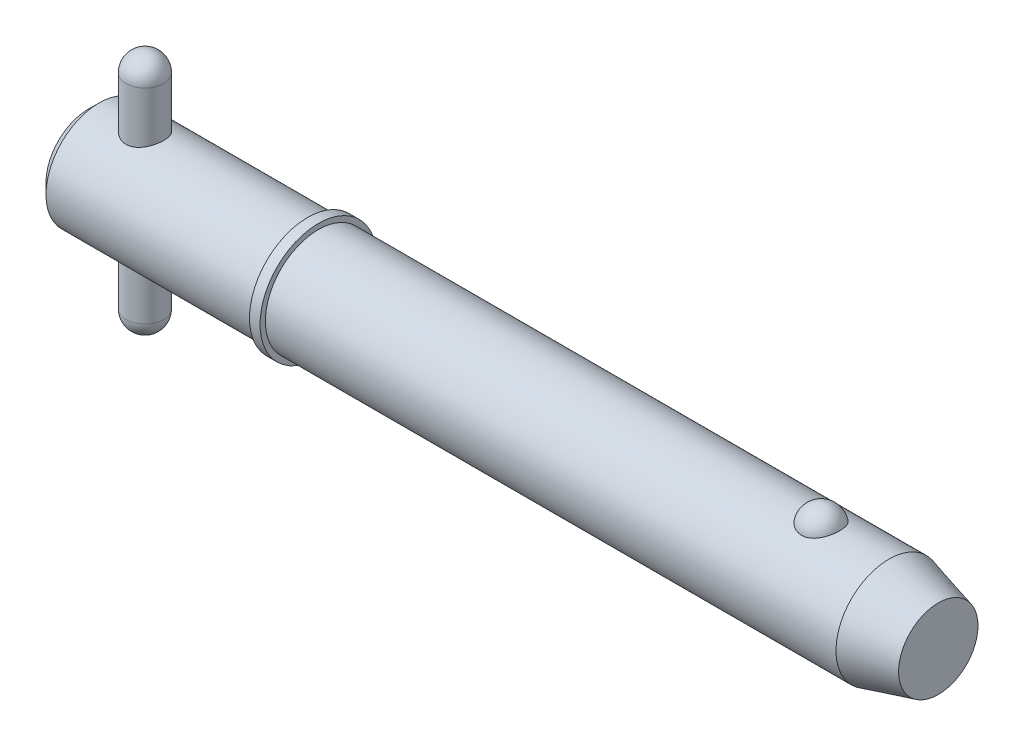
ISO-10303-21;
HEADER;
FILE_DESCRIPTION(('STEP AP214'),'2;1');
FILE_NAME('part.step','',(''),(''),'','','');
FILE_SCHEMA(('AUTOMOTIVE_DESIGN { 1 0 10303 214 1 1 1 1 }'));
ENDSEC;
DATA;
#1=APPLICATION_CONTEXT('core data for automotive mechanical design processes');
#2=APPLICATION_PROTOCOL_DEFINITION('international standard','automotive_design',2000,#1);
#3=PRODUCT_CONTEXT('',#1,'mechanical');
#4=PRODUCT('Part','Part','',(#3));
#5=PRODUCT_RELATED_PRODUCT_CATEGORY('part','',(#4));
#6=PRODUCT_DEFINITION_FORMATION('','',#4);
#7=PRODUCT_DEFINITION_CONTEXT('part definition',#1,'design');
#8=PRODUCT_DEFINITION('design','',#6,#7);
#9=PRODUCT_DEFINITION_SHAPE('','',#8);
#10=(LENGTH_UNIT() NAMED_UNIT(*) SI_UNIT(.MILLI.,.METRE.));
#11=(NAMED_UNIT(*) PLANE_ANGLE_UNIT() SI_UNIT($,.RADIAN.));
#12=(NAMED_UNIT(*) SI_UNIT($,.STERADIAN.) SOLID_ANGLE_UNIT());
#13=UNCERTAINTY_MEASURE_WITH_UNIT(LENGTH_MEASURE(1.E-05),#10,'distance_accuracy_value','');
#14=(GEOMETRIC_REPRESENTATION_CONTEXT(3) GLOBAL_UNCERTAINTY_ASSIGNED_CONTEXT((#13)) GLOBAL_UNIT_ASSIGNED_CONTEXT((#10,
#11,#12)) REPRESENTATION_CONTEXT('',''));
#15=CARTESIAN_POINT('',(0.,0.,0.));
#16=DIRECTION('',(0.,0.,1.));
#17=DIRECTION('',(1.,0.,0.));
#18=AXIS2_PLACEMENT_3D('',#15,#16,#17);
#19=CARTESIAN_POINT('',(5.94,12.7,0.));
#20=DIRECTION('',(0.,-1.,0.));
#21=DIRECTION('',(0.,0.,-1.));
#22=AXIS2_PLACEMENT_3D('',#19,#20,#21);
#23=CYLINDRICAL_SURFACE('',#22,1.98);
#24=CARTESIAN_POINT('',(5.94,-10.72,0.));
#25=DIRECTION('',(0.,-1.,0.));
#26=DIRECTION('',(0.,0.,-1.));
#27=AXIS2_PLACEMENT_3D('',#24,#25,#26);
#28=CIRCLE('',#27,1.98);
#29=CARTESIAN_POINT('',(5.94,-10.72,-1.98));
#30=VERTEX_POINT('',#29);
#31=EDGE_CURVE('P0_E10',#30,#30,#28,.F.);
#32=ORIENTED_EDGE('',*,*,#31,.T.);
#33=EDGE_LOOP('',(#32));
#34=FACE_BOUND('',#33,.T.);
#35=CARTESIAN_POINT('',(5.94,10.72,0.));
#36=DIRECTION('',(0.,-1.,0.));
#37=DIRECTION('',(0.,0.,-1.));
#38=AXIS2_PLACEMENT_3D('',#35,#36,#37);
#39=CIRCLE('',#38,1.98);
#40=CARTESIAN_POINT('',(5.94,10.72,-1.98));
#41=VERTEX_POINT('',#40);
#42=EDGE_CURVE('P0_E21',#41,#41,#39,.T.);
#43=ORIENTED_EDGE('',*,*,#42,.T.);
#44=EDGE_LOOP('',(#43));
#45=FACE_BOUND('',#44,.T.);
#46=ADVANCED_FACE('P0_F14',(#34,#45),#23,.T.);
#47=CARTESIAN_POINT('',(5.94,-10.72,0.));
#48=DIRECTION('',(0.,0.,1.));
#49=DIRECTION('',(1.,0.,0.));
#50=AXIS2_PLACEMENT_3D('',#47,#48,#49);
#51=SPHERICAL_SURFACE('',#50,1.98);
#52=CARTESIAN_POINT('',(5.94,-10.72,0.));
#53=DIRECTION('',(0.,-1.,0.));
#54=DIRECTION('',(0.,0.,-1.));
#55=AXIS2_PLACEMENT_3D('',#52,#53,#54);
#56=SPHERICAL_SURFACE('',#55,1.98);
#57=ORIENTED_EDGE('',*,*,#31,.F.);
#58=EDGE_LOOP('',(#57));
#59=FACE_BOUND('',#58,.T.);
#60=ADVANCED_FACE('P0_F29',(#59),#56,.T.);
#61=CARTESIAN_POINT('',(5.94,10.72,0.));
#62=DIRECTION('',(0.,0.,1.));
#63=DIRECTION('',(1.,0.,0.));
#64=AXIS2_PLACEMENT_3D('',#61,#62,#63);
#65=SPHERICAL_SURFACE('',#64,1.98);
#66=CARTESIAN_POINT('',(5.94,10.72,0.));
#67=DIRECTION('',(0.,-1.,0.));
#68=DIRECTION('',(0.,0.,-1.));
#69=AXIS2_PLACEMENT_3D('',#66,#67,#68);
#70=SPHERICAL_SURFACE('',#69,1.98);
#71=ORIENTED_EDGE('',*,*,#42,.F.);
#72=EDGE_LOOP('',(#71));
#73=FACE_BOUND('',#72,.T.);
#74=ADVANCED_FACE('P0_F16',(#73),#70,.T.);
#75=CLOSED_SHELL('',(#46,#60,#74));
#76=MANIFOLD_SOLID_BREP('P0_B1',#75);
#77=CARTESIAN_POINT('',(0.,0.,0.));
#78=DIRECTION('',(1.,0.,0.));
#79=DIRECTION('',(0.,0.,-1.));
#80=AXIS2_PLACEMENT_3D('',#77,#78,#79);
#81=CYLINDRICAL_SURFACE('',#80,5.555);
#82=CARTESIAN_POINT('',(84.0171144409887,0.,0.));
#83=DIRECTION('',(1.,0.,0.));
#84=DIRECTION('',(0.,0.,-1.));
#85=AXIS2_PLACEMENT_3D('',#82,#83,#84);
#86=CIRCLE('',#85,5.555);
#87=CARTESIAN_POINT('',(84.0171144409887,0.,-5.555));
#88=VERTEX_POINT('',#87);
#89=EDGE_CURVE('P1_E81',#88,#88,#86,.T.);
#90=ORIENTED_EDGE('',*,*,#89,.F.);
#91=EDGE_LOOP('',(#90));
#92=FACE_BOUND('',#91,.T.);
#93=CARTESIAN_POINT('',(24.13,0.,0.));
#94=DIRECTION('',(1.,0.,0.));
#95=DIRECTION('',(0.,0.,-1.));
#96=AXIS2_PLACEMENT_3D('',#93,#94,#95);
#97=CIRCLE('',#96,5.555);
#98=CARTESIAN_POINT('',(24.13,0.,-5.555));
#99=VERTEX_POINT('',#98);
#100=EDGE_CURVE('P1_E85',#99,#99,#97,.T.);
#101=ORIENTED_EDGE('',*,*,#100,.T.);
#102=EDGE_LOOP('',(#101));
#103=FACE_BOUND('',#102,.T.);
#104=CARTESIAN_POINT('',(76.8986264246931,5.16741224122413,2.03859650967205));
#105=CARTESIAN_POINT('',(76.7929492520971,5.16740893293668,2.03859990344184));
#106=CARTESIAN_POINT('',(76.68729894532,5.17079470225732,2.03008306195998));
#107=CARTESIAN_POINT('',(76.4791419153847,5.18392795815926,1.9963072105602));
#108=CARTESIAN_POINT('',(76.3766344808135,5.19367399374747,1.9710520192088));
#109=CARTESIAN_POINT('',(76.1777710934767,5.21839168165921,1.90463997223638));
#110=CARTESIAN_POINT('',(76.0814064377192,5.23335573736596,1.86350622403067));
#111=CARTESIAN_POINT('',(75.8970804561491,5.26688076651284,1.76652592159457));
#112=CARTESIAN_POINT('',(75.8091207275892,5.28544242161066,1.71067657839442));
#113=CARTESIAN_POINT('',(75.6412654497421,5.32479845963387,1.58399959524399));
#114=CARTESIAN_POINT('',(75.5616656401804,5.34564089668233,1.51279545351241));
#115=CARTESIAN_POINT('',(75.4151290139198,5.38697258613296,1.35828584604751));
#116=CARTESIAN_POINT('',(75.348194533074,5.40746177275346,1.27497815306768));
#117=CARTESIAN_POINT('',(75.2256103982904,5.44694508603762,1.09440293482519));
#118=CARTESIAN_POINT('',(75.1705989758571,5.46583143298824,0.996677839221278));
#119=CARTESIAN_POINT('',(75.0769376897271,5.49908030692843,0.792961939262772));
#120=CARTESIAN_POINT('',(75.0382894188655,5.513442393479,0.686970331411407));
#121=CARTESIAN_POINT('',(74.9776807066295,5.536358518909,0.468019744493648));
#122=CARTESIAN_POINT('',(74.9559725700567,5.54482455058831,0.354981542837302));
#123=CARTESIAN_POINT('',(74.9306362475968,5.55473324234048,0.126595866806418));
#124=CARTESIAN_POINT('',(74.9270077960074,5.55617600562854,0.0112484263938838));
#125=CARTESIAN_POINT('',(74.9378817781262,5.55189984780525,-0.218011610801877));
#126=CARTESIAN_POINT('',(74.9523151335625,5.54620821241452,-0.331928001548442));
#127=CARTESIAN_POINT('',(74.998903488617,5.52828920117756,-0.555544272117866));
#128=CARTESIAN_POINT('',(75.0310588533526,5.5160616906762,-0.665244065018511));
#129=CARTESIAN_POINT('',(75.1124883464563,5.48630779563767,-0.877469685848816));
#130=CARTESIAN_POINT('',(75.1617816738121,5.4687754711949,-0.979987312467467));
#131=CARTESIAN_POINT('',(75.2764785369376,5.43024700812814,-1.17486975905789));
#132=CARTESIAN_POINT('',(75.3418831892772,5.4092506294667,-1.26723387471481));
#133=CARTESIAN_POINT('',(75.4875712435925,5.36600927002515,-1.43940133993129));
#134=CARTESIAN_POINT('',(75.5678859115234,5.34376173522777,-1.5191776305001));
#135=CARTESIAN_POINT('',(75.7414520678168,5.30057971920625,-1.66360338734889));
#136=CARTESIAN_POINT('',(75.834702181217,5.27964509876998,-1.72825445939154));
#137=CARTESIAN_POINT('',(76.0293939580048,5.24205250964,-1.8390947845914));
#138=CARTESIAN_POINT('',(76.1305900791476,5.22530519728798,-1.88568407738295));
#139=CARTESIAN_POINT('',(76.3401552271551,5.19750919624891,-1.96100802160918));
#140=CARTESIAN_POINT('',(76.4485215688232,5.18645838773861,-1.98974931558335));
#141=CARTESIAN_POINT('',(76.6634989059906,5.17184410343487,-2.02742262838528));
#142=CARTESIAN_POINT('',(76.769925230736,5.16793282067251,-2.0372760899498));
#143=CARTESIAN_POINT('',(76.9829925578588,5.1669899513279,-2.03966777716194));
#144=CARTESIAN_POINT('',(77.0896335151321,5.16995704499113,-2.03220932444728));
#145=CARTESIAN_POINT('',(77.2967730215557,5.18222383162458,-2.0007117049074));
#146=CARTESIAN_POINT('',(77.3973599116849,5.19133213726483,-1.97717337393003));
#147=CARTESIAN_POINT('',(77.5930141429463,5.21467637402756,-1.91475248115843));
#148=CARTESIAN_POINT('',(77.6880810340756,5.22891272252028,-1.87586867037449));
#149=CARTESIAN_POINT('',(77.872371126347,5.26137066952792,-1.78282713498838));
#150=CARTESIAN_POINT('',(77.9614190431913,5.27967329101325,-1.7283512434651));
#151=CARTESIAN_POINT('',(78.1292880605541,5.31817411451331,-1.60597483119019));
#152=CARTESIAN_POINT('',(78.2081068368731,5.33837274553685,-1.53807126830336));
#153=CARTESIAN_POINT('',(78.3575156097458,5.37968287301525,-1.38688970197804));
#154=CARTESIAN_POINT('',(78.4275058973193,5.40079011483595,-1.30301744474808));
#155=CARTESIAN_POINT('',(78.5530125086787,5.44074401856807,-1.12458170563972));
#156=CARTESIAN_POINT('',(78.6085262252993,5.45959027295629,-1.03001630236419));
#157=CARTESIAN_POINT('',(78.7055507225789,5.49369849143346,-0.829439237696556));
#158=CARTESIAN_POINT('',(78.7465483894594,5.50882422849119,-0.723155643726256));
#159=CARTESIAN_POINT('',(78.8111250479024,5.53310911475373,-0.504772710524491));
#160=CARTESIAN_POINT('',(78.8347036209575,5.54226812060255,-0.39267323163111));
#161=CARTESIAN_POINT('',(78.864013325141,5.55370358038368,-0.165459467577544));
#162=CARTESIAN_POINT('',(78.8696884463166,5.55595843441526,-0.0503368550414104));
#163=CARTESIAN_POINT('',(78.862916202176,5.55329317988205,0.179288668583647));
#164=CARTESIAN_POINT('',(78.8504690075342,5.54837313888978,0.293791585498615));
#165=CARTESIAN_POINT('',(78.8077798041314,5.53189037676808,0.518526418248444));
#166=CARTESIAN_POINT('',(78.777598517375,5.5203503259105,0.628771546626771));
#167=CARTESIAN_POINT('',(78.7000962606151,5.49182453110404,0.84231815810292));
#168=CARTESIAN_POINT('',(78.6527743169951,5.47483847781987,0.945619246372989));
#169=CARTESIAN_POINT('',(78.5417204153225,5.43710633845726,1.14281571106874));
#170=CARTESIAN_POINT('',(78.4779215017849,5.41634501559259,1.23667048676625));
#171=CARTESIAN_POINT('',(78.3353577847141,5.37334572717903,1.4118524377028));
#172=CARTESIAN_POINT('',(78.2565932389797,5.35110778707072,1.49317982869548));
#173=CARTESIAN_POINT('',(78.0864234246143,5.30779474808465,1.64049162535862));
#174=CARTESIAN_POINT('',(77.9951002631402,5.28671324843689,1.70656877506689));
#175=CARTESIAN_POINT('',(77.8017390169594,5.2480485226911,1.82201372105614));
#176=CARTESIAN_POINT('',(77.6997005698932,5.23046541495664,1.87138095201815));
#177=CARTESIAN_POINT('',(77.4836187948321,5.20042692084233,1.95335298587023));
#178=CARTESIAN_POINT('',(77.369260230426,5.18820192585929,1.98521734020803));
#179=CARTESIAN_POINT('',(77.1361307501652,5.17169804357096,2.02783294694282));
#180=CARTESIAN_POINT('',(77.0173616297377,5.16741595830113,2.03859269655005));
#181=CARTESIAN_POINT('',(76.8986264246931,5.16741224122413,2.03859650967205));
#182=B_SPLINE_CURVE_WITH_KNOTS('',3,(#104,#105,#106,#107,#108,#109,#110,#111,#112,#113,#114,
#115,#116,#117,#118,#119,#120,#121,#122,#123,#124,#125,#126,#127,#128,#129,#130,#131,#132,#133,
#134,#135,#136,#137,#138,#139,#140,#141,#142,#143,#144,#145,#146,#147,#148,#149,#150,#151,#152,
#153,#154,#155,#156,#157,#158,#159,#160,#161,#162,#163,#164,#165,#166,#167,#168,#169,#170,#171,
#172,#173,#174,#175,#176,#177,#178,#179,#180,#181),.UNSPECIFIED.,.T.,.F.,(4,2,2,2,2,2,2,2,2,2,2,
2,2,2,2,2,2,2,2,2,2,2,2,2,2,2,2,2,2,2,2,2,2,2,2,2,2,2,4),(0.,0.316595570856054,
0.633118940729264,0.949183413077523,1.26530783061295,1.59030762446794,1.91536729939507,
2.25495824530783,2.59458224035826,2.93917283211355,3.28375835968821,3.62703002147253,
3.97030875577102,4.3139732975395,4.65766166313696,5.00207904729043,5.3464598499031,
5.68270547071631,6.0188258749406,6.33808403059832,6.65728093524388,6.96696376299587,
7.27667180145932,7.59321535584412,7.90983070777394,8.24210387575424,8.57443684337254,
8.91755896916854,9.26068933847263,9.60489211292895,9.949091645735,10.2921194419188,
10.6351667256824,10.9796305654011,11.324088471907,11.666392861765,12.0087088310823,
12.3645679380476,12.7202837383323),.UNSPECIFIED.);
#183=CARTESIAN_POINT('',(76.8986264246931,5.16741224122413,2.03859650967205));
#184=VERTEX_POINT('',#183);
#185=EDGE_CURVE('P1_E35',#184,#184,#182,.T.);
#186=ORIENTED_EDGE('',*,*,#185,.T.);
#187=EDGE_LOOP('',(#186));
#188=FACE_BOUND('',#187,.T.);
#189=ADVANCED_FACE('P1_F13',(#92,#103,#188),#81,.T.);
#190=CARTESIAN_POINT('',(0.,0.,0.));
#191=DIRECTION('',(-1.,0.,0.));
#192=DIRECTION('',(0.,0.,1.));
#193=AXIS2_PLACEMENT_3D('',#190,#191,#192);
#194=PLANE('',#193);
#195=CARTESIAN_POINT('',(0.,0.,0.));
#196=DIRECTION('',(1.,0.,0.));
#197=DIRECTION('',(0.,0.,-1.));
#198=AXIS2_PLACEMENT_3D('',#195,#196,#197);
#199=CIRCLE('',#198,4.444);
#200=CARTESIAN_POINT('',(0.,0.,-4.444));
#201=VERTEX_POINT('',#200);
#202=EDGE_CURVE('P1_E9',#201,#201,#199,.T.);
#203=ORIENTED_EDGE('',*,*,#202,.F.);
#204=EDGE_LOOP('',(#203));
#205=FACE_BOUND('',#204,.T.);
#206=ADVANCED_FACE('P1_F15',(#205),#194,.T.);
#207=CARTESIAN_POINT('',(1.111,0.,0.));
#208=DIRECTION('',(1.,0.,0.));
#209=DIRECTION('',(0.,0.,-1.));
#210=AXIS2_PLACEMENT_3D('',#207,#208,#209);
#211=CONICAL_SURFACE('',#210,5.555,0.78539816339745);
#212=ORIENTED_EDGE('',*,*,#202,.T.);
#213=EDGE_LOOP('',(#212));
#214=FACE_BOUND('',#213,.T.);
#215=CARTESIAN_POINT('',(1.111,0.,0.));
#216=DIRECTION('',(1.,0.,0.));
#217=DIRECTION('',(0.,0.,-1.));
#218=AXIS2_PLACEMENT_3D('',#215,#216,#217);
#219=CIRCLE('',#218,5.555);
#220=CARTESIAN_POINT('',(1.111,0.,-5.555));
#221=VERTEX_POINT('',#220);
#222=EDGE_CURVE('P1_E26',#221,#221,#219,.T.);
#223=ORIENTED_EDGE('',*,*,#222,.F.);
#224=EDGE_LOOP('',(#223));
#225=FACE_BOUND('',#224,.T.);
#226=ADVANCED_FACE('P1_F77',(#214,#225),#211,.T.);
#227=CARTESIAN_POINT('',(0.,0.,0.));
#228=DIRECTION('',(1.,0.,0.));
#229=DIRECTION('',(0.,0.,-1.));
#230=AXIS2_PLACEMENT_3D('',#227,#228,#229);
#231=CYLINDRICAL_SURFACE('',#230,5.555);
#232=CARTESIAN_POINT('',(5.94,-5.19014691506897,1.98));
#233=CARTESIAN_POINT('',(5.83264687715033,-5.19014494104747,1.98000226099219));
#234=CARTESIAN_POINT('',(5.7253094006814,-5.19351395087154,1.97123988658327));
#235=CARTESIAN_POINT('',(5.51384517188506,-5.20654291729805,1.93656219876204));
#236=CARTESIAN_POINT('',(5.40971858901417,-5.21620320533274,1.91064598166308));
#237=CARTESIAN_POINT('',(5.20778082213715,-5.24058443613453,1.84271148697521));
#238=CARTESIAN_POINT('',(5.10995634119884,-5.25529427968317,1.80072850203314));
#239=CARTESIAN_POINT('',(4.92270352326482,-5.28810012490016,1.70197537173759));
#240=CARTESIAN_POINT('',(4.83327743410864,-5.3061970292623,1.64520128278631));
#241=CARTESIAN_POINT('',(4.66135184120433,-5.34464714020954,1.51575187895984));
#242=CARTESIAN_POINT('',(4.57928277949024,-5.36506222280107,1.44252311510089));
#243=CARTESIAN_POINT('',(4.42829115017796,-5.40532920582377,1.28342047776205));
#244=CARTESIAN_POINT('',(4.35937105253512,-5.42518099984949,1.19754423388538));
#245=CARTESIAN_POINT('',(4.23461605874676,-5.46281133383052,1.01237205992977));
#246=CARTESIAN_POINT('',(4.17924129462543,-5.48050875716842,0.912748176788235));
#247=CARTESIAN_POINT('',(4.0862117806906,-5.51109938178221,0.70485824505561));
#248=CARTESIAN_POINT('',(4.0485515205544,-5.52399407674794,0.596594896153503));
#249=CARTESIAN_POINT('',(3.99350662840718,-5.54308759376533,0.379019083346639));
#250=CARTESIAN_POINT('',(3.97538263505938,-5.54952987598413,0.269915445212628));
#251=CARTESIAN_POINT('',(3.95756405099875,-5.55586205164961,0.0500378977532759));
#252=CARTESIAN_POINT('',(3.95786404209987,-5.55575387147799,-0.060735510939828));
#253=CARTESIAN_POINT('',(3.97643665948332,-5.54915684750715,-0.275539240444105));
#254=CARTESIAN_POINT('',(3.99390415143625,-5.54295384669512,-0.379649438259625));
#255=CARTESIAN_POINT('',(4.0449721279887,-5.52523170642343,-0.583350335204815));
#256=CARTESIAN_POINT('',(4.07857373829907,-5.51371219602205,-0.682940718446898));
#257=CARTESIAN_POINT('',(4.16137312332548,-5.4863099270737,-0.876423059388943));
#258=CARTESIAN_POINT('',(4.2107826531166,-5.47036834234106,-0.970215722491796));
#259=CARTESIAN_POINT('',(4.32361427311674,-5.43575653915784,-1.1484017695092));
#260=CARTESIAN_POINT('',(4.38704062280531,-5.41708549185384,-1.23279228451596));
#261=CARTESIAN_POINT('',(4.53006791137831,-5.37778429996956,-1.39454579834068));
#262=CARTESIAN_POINT('',(4.61035105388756,-5.35710277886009,-1.4712940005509));
#263=CARTESIAN_POINT('',(4.78279835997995,-5.31692766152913,-1.6104545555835));
#264=CARTESIAN_POINT('',(4.874964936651,-5.29743430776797,-1.67286398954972));
#265=CARTESIAN_POINT('',(5.07076688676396,-5.26153775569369,-1.78259698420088));
#266=CARTESIAN_POINT('',(5.17458163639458,-5.24519780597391,-1.8296227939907));
#267=CARTESIAN_POINT('',(5.38938990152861,-5.21818744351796,-1.90530278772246));
#268=CARTESIAN_POINT('',(5.50037985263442,-5.20751423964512,-1.93396601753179));
#269=CARTESIAN_POINT('',(5.72036376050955,-5.19369176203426,-1.97077654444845));
#270=CARTESIAN_POINT('',(5.82917370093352,-5.19018851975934,-1.97989015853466));
#271=CARTESIAN_POINT('',(6.04680100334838,-5.19010609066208,-1.98010779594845));
#272=CARTESIAN_POINT('',(6.15561835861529,-5.19352540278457,-1.97121572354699));
#273=CARTESIAN_POINT('',(6.36548036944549,-5.20654623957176,-1.93654727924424));
#274=CARTESIAN_POINT('',(6.46666051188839,-5.21588705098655,-1.91148218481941));
#275=CARTESIAN_POINT('',(6.66334537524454,-5.23939939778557,-1.84605494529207));
#276=CARTESIAN_POINT('',(6.75884899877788,-5.25357186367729,-1.8056898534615));
#277=CARTESIAN_POINT('',(6.94517989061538,-5.28576258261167,-1.70921153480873));
#278=CARTESIAN_POINT('',(7.03572661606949,-5.30389804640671,-1.65259670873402));
#279=CARTESIAN_POINT('',(7.20638087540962,-5.34176077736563,-1.52577523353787));
#280=CARTESIAN_POINT('',(7.28648490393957,-5.36148857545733,-1.45556404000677));
#281=CARTESIAN_POINT('',(7.43864697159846,-5.40165494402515,-1.2988614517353));
#282=CARTESIAN_POINT('',(7.50999887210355,-5.42207106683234,-1.21167640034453));
#283=CARTESIAN_POINT('',(7.63712639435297,-5.46023601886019,-1.026066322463));
#284=CARTESIAN_POINT('',(7.69290228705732,-5.47798489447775,-0.927641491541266));
#285=CARTESIAN_POINT('',(7.78684673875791,-5.50876590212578,-0.722633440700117));
#286=CARTESIAN_POINT('',(7.82510508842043,-5.52182201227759,-0.616095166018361));
#287=CARTESIAN_POINT('',(7.88297051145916,-5.54184206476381,-0.397530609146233));
#288=CARTESIAN_POINT('',(7.90258540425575,-5.5488085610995,-0.285506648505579));
#289=CARTESIAN_POINT('',(7.9218262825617,-5.55564472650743,-0.065566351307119));
#290=CARTESIAN_POINT('',(7.92245987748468,-5.55587212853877,0.0422515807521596));
#291=CARTESIAN_POINT('',(7.90626329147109,-5.55011340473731,0.256387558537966));
#292=CARTESIAN_POINT('',(7.88943488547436,-5.54412791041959,0.362705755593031));
#293=CARTESIAN_POINT('',(7.83948457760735,-5.52676548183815,0.568649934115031));
#294=CARTESIAN_POINT('',(7.8067003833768,-5.51550046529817,0.668367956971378));
#295=CARTESIAN_POINT('',(7.72609369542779,-5.48874437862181,0.860911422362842));
#296=CARTESIAN_POINT('',(7.67826838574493,-5.47325251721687,0.953735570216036));
#297=CARTESIAN_POINT('',(7.56675024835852,-5.43884382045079,1.13391068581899));
#298=CARTESIAN_POINT('',(7.50249968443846,-5.41981485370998,1.22089468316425));
#299=CARTESIAN_POINT('',(7.36086495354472,-5.38069275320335,1.38316665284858));
#300=CARTESIAN_POINT('',(7.28347630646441,-5.36059925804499,1.45845061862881));
#301=CARTESIAN_POINT('',(7.11347587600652,-5.32048380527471,1.59876646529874));
#302=CARTESIAN_POINT('',(7.02032386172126,-5.30050854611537,1.66315951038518));
#303=CARTESIAN_POINT('',(6.82388804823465,-5.26398994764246,1.77536801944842));
#304=CARTESIAN_POINT('',(6.7206049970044,-5.24744635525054,1.82318470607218));
#305=CARTESIAN_POINT('',(6.50639706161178,-5.21987969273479,1.90068230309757));
#306=CARTESIAN_POINT('',(6.3954529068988,-5.20887116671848,1.93031547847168));
#307=CARTESIAN_POINT('',(6.16966522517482,-5.19400760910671,1.96996824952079));
#308=CARTESIAN_POINT('',(6.05482366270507,-5.19014902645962,1.97999758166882));
#309=CARTESIAN_POINT('',(5.94,-5.19014691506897,1.98));
#310=B_SPLINE_CURVE_WITH_KNOTS('',3,(#232,#233,#234,#235,#236,#237,#238,#239,#240,#241,#242,
#243,#244,#245,#246,#247,#248,#249,#250,#251,#252,#253,#254,#255,#256,#257,#258,#259,#260,#261,
#262,#263,#264,#265,#266,#267,#268,#269,#270,#271,#272,#273,#274,#275,#276,#277,#278,#279,#280,
#281,#282,#283,#284,#285,#286,#287,#288,#289,#290,#291,#292,#293,#294,#295,#296,#297,#298,#299,
#300,#301,#302,#303,#304,#305,#306,#307,#308,#309),.UNSPECIFIED.,.T.,.F.,(4,2,2,2,2,2,2,2,2,2,2,
2,2,2,2,2,2,2,2,2,2,2,2,2,2,2,2,2,2,2,2,2,2,2,2,2,2,2,4),(0.,0.321632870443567,
0.643282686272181,0.964229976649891,1.28526292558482,1.61937087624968,1.9535415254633,
2.29784481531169,2.64204093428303,2.97269632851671,3.30325448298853,3.61901541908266,
3.93479838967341,4.25500220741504,4.57530346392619,4.91268648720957,5.25013812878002,
5.59378026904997,5.93725299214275,6.26331481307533,6.58930593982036,6.90185604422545,
7.21446637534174,7.53801472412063,7.86167140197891,8.20353561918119,8.54539388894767,
8.88547970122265,9.22542281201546,9.54728637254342,9.86911722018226,10.1844146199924,
10.4997710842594,10.827730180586,11.1558013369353,11.499115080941,11.8424034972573,
12.1865892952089,12.5306041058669),.UNSPECIFIED.);
#311=CARTESIAN_POINT('',(5.94,-5.19014691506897,1.98));
#312=VERTEX_POINT('',#311);
#313=EDGE_CURVE('P1_E17',#312,#312,#310,.T.);
#314=ORIENTED_EDGE('',*,*,#313,.F.);
#315=EDGE_LOOP('',(#314));
#316=FACE_BOUND('',#315,.T.);
#317=CARTESIAN_POINT('',(5.94,5.19014691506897,1.98));
#318=CARTESIAN_POINT('',(6.04735312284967,5.19014494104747,1.98000226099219));
#319=CARTESIAN_POINT('',(6.1546905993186,5.19351395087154,1.97123988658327));
#320=CARTESIAN_POINT('',(6.36615482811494,5.20654291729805,1.93656219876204));
#321=CARTESIAN_POINT('',(6.47028141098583,5.21620320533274,1.91064598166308));
#322=CARTESIAN_POINT('',(6.67221917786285,5.24058443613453,1.84271148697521));
#323=CARTESIAN_POINT('',(6.77004365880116,5.25529427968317,1.80072850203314));
#324=CARTESIAN_POINT('',(6.95729647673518,5.28810012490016,1.70197537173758));
#325=CARTESIAN_POINT('',(7.04672256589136,5.3061970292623,1.64520128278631));
#326=CARTESIAN_POINT('',(7.21864815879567,5.34464714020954,1.51575187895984));
#327=CARTESIAN_POINT('',(7.30071722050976,5.36506222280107,1.44252311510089));
#328=CARTESIAN_POINT('',(7.45170884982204,5.40532920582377,1.28342047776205));
#329=CARTESIAN_POINT('',(7.52062894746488,5.42518099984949,1.19754423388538));
#330=CARTESIAN_POINT('',(7.64538394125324,5.46281133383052,1.01237205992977));
#331=CARTESIAN_POINT('',(7.70075870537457,5.48050875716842,0.912748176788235));
#332=CARTESIAN_POINT('',(7.7937882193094,5.51109938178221,0.704858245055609));
#333=CARTESIAN_POINT('',(7.8314484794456,5.52399407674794,0.596594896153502));
#334=CARTESIAN_POINT('',(7.88649337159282,5.54308759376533,0.379019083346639));
#335=CARTESIAN_POINT('',(7.90461736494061,5.54952987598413,0.269915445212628));
#336=CARTESIAN_POINT('',(7.92243594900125,5.55586205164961,0.0500378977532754));
#337=CARTESIAN_POINT('',(7.92213595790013,5.55575387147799,-0.0607355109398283));
#338=CARTESIAN_POINT('',(7.90356334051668,5.54915684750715,-0.275539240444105));
#339=CARTESIAN_POINT('',(7.88609584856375,5.54295384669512,-0.379649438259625));
#340=CARTESIAN_POINT('',(7.8350278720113,5.52523170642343,-0.583350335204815));
#341=CARTESIAN_POINT('',(7.80142626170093,5.51371219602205,-0.682940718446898));
#342=CARTESIAN_POINT('',(7.71862687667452,5.4863099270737,-0.876423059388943));
#343=CARTESIAN_POINT('',(7.6692173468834,5.47036834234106,-0.970215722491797));
#344=CARTESIAN_POINT('',(7.55638572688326,5.43575653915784,-1.1484017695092));
#345=CARTESIAN_POINT('',(7.49295937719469,5.41708549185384,-1.23279228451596));
#346=CARTESIAN_POINT('',(7.34993208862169,5.37778429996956,-1.39454579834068));
#347=CARTESIAN_POINT('',(7.26964894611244,5.35710277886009,-1.4712940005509));
#348=CARTESIAN_POINT('',(7.09720164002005,5.31692766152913,-1.6104545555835));
#349=CARTESIAN_POINT('',(7.00503506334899,5.29743430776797,-1.67286398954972));
#350=CARTESIAN_POINT('',(6.80923311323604,5.26153775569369,-1.78259698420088));
#351=CARTESIAN_POINT('',(6.70541836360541,5.24519780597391,-1.8296227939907));
#352=CARTESIAN_POINT('',(6.49061009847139,5.21818744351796,-1.90530278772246));
#353=CARTESIAN_POINT('',(6.37962014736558,5.20751423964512,-1.93396601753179));
#354=CARTESIAN_POINT('',(6.15963623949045,5.19369176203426,-1.97077654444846));
#355=CARTESIAN_POINT('',(6.05082629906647,5.19018851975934,-1.97989015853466));
#356=CARTESIAN_POINT('',(5.83319899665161,5.19010609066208,-1.98010779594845));
#357=CARTESIAN_POINT('',(5.7243816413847,5.19352540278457,-1.97121572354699));
#358=CARTESIAN_POINT('',(5.5145196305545,5.20654623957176,-1.93654727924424));
#359=CARTESIAN_POINT('',(5.4133394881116,5.21588705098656,-1.91148218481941));
#360=CARTESIAN_POINT('',(5.21665462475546,5.23939939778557,-1.84605494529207));
#361=CARTESIAN_POINT('',(5.12115100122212,5.25357186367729,-1.8056898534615));
#362=CARTESIAN_POINT('',(4.93482010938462,5.28576258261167,-1.70921153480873));
#363=CARTESIAN_POINT('',(4.84427338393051,5.30389804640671,-1.65259670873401));
#364=CARTESIAN_POINT('',(4.67361912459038,5.34176077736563,-1.52577523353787));
#365=CARTESIAN_POINT('',(4.59351509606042,5.36148857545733,-1.45556404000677));
#366=CARTESIAN_POINT('',(4.44135302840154,5.40165494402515,-1.2988614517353));
#367=CARTESIAN_POINT('',(4.37000112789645,5.42207106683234,-1.21167640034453));
#368=CARTESIAN_POINT('',(4.24287360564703,5.46023601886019,-1.026066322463));
#369=CARTESIAN_POINT('',(4.18709771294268,5.47798489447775,-0.927641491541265));
#370=CARTESIAN_POINT('',(4.09315326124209,5.50876590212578,-0.722633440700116));
#371=CARTESIAN_POINT('',(4.05489491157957,5.52182201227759,-0.61609516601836));
#372=CARTESIAN_POINT('',(3.99702948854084,5.54184206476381,-0.397530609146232));
#373=CARTESIAN_POINT('',(3.97741459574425,5.5488085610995,-0.285506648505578));
#374=CARTESIAN_POINT('',(3.9581737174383,5.55564472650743,-0.0655663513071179));
#375=CARTESIAN_POINT('',(3.95754012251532,5.55587212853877,0.0422515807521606));
#376=CARTESIAN_POINT('',(3.97373670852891,5.55011340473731,0.256387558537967));
#377=CARTESIAN_POINT('',(3.99056511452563,5.54412791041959,0.362705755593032));
#378=CARTESIAN_POINT('',(4.04051542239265,5.52676548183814,0.568649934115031));
#379=CARTESIAN_POINT('',(4.07329961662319,5.51550046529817,0.668367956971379));
#380=CARTESIAN_POINT('',(4.15390630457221,5.48874437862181,0.860911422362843));
#381=CARTESIAN_POINT('',(4.20173161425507,5.47325251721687,0.953735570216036));
#382=CARTESIAN_POINT('',(4.31324975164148,5.43884382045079,1.13391068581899));
#383=CARTESIAN_POINT('',(4.37750031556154,5.41981485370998,1.22089468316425));
#384=CARTESIAN_POINT('',(4.51913504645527,5.38069275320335,1.38316665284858));
#385=CARTESIAN_POINT('',(4.59652369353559,5.36059925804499,1.45845061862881));
#386=CARTESIAN_POINT('',(4.76652412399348,5.32048380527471,1.59876646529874));
#387=CARTESIAN_POINT('',(4.85967613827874,5.30050854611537,1.66315951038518));
#388=CARTESIAN_POINT('',(5.05611195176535,5.26398994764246,1.77536801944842));
#389=CARTESIAN_POINT('',(5.1593950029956,5.24744635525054,1.82318470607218));
#390=CARTESIAN_POINT('',(5.37360293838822,5.21987969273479,1.90068230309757));
#391=CARTESIAN_POINT('',(5.4845470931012,5.20887116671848,1.93031547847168));
#392=CARTESIAN_POINT('',(5.71033477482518,5.19400760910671,1.96996824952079));
#393=CARTESIAN_POINT('',(5.82517633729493,5.19014902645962,1.97999758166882));
#394=CARTESIAN_POINT('',(5.94,5.19014691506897,1.98));
#395=B_SPLINE_CURVE_WITH_KNOTS('',3,(#317,#318,#319,#320,#321,#322,#323,#324,#325,#326,#327,
#328,#329,#330,#331,#332,#333,#334,#335,#336,#337,#338,#339,#340,#341,#342,#343,#344,#345,#346,
#347,#348,#349,#350,#351,#352,#353,#354,#355,#356,#357,#358,#359,#360,#361,#362,#363,#364,#365,
#366,#367,#368,#369,#370,#371,#372,#373,#374,#375,#376,#377,#378,#379,#380,#381,#382,#383,#384,
#385,#386,#387,#388,#389,#390,#391,#392,#393,#394),.UNSPECIFIED.,.T.,.F.,(4,2,2,2,2,2,2,2,2,2,2,
2,2,2,2,2,2,2,2,2,2,2,2,2,2,2,2,2,2,2,2,2,2,2,2,2,2,2,4),(0.,0.321632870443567,
0.643282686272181,0.964229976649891,1.28526292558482,1.61937087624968,1.9535415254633,
2.29784481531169,2.64204093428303,2.97269632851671,3.30325448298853,3.61901541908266,
3.93479838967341,4.25500220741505,4.57530346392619,4.91268648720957,5.25013812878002,
5.59378026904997,5.93725299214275,6.26331481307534,6.58930593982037,6.90185604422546,
7.21446637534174,7.53801472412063,7.86167140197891,8.20353561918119,8.54539388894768,
8.88547970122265,9.22542281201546,9.54728637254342,9.86911722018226,10.1844146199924,
10.4997710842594,10.827730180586,11.1558013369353,11.499115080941,11.8424034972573,
12.1865892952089,12.5306041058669),.UNSPECIFIED.);
#396=CARTESIAN_POINT('',(5.94,5.19014691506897,1.98));
#397=VERTEX_POINT('',#396);
#398=EDGE_CURVE('P1_E43',#397,#397,#395,.T.);
#399=ORIENTED_EDGE('',*,*,#398,.F.);
#400=EDGE_LOOP('',(#399));
#401=FACE_BOUND('',#400,.T.);
#402=ORIENTED_EDGE('',*,*,#222,.T.);
#403=EDGE_LOOP('',(#402));
#404=FACE_BOUND('',#403,.T.);
#405=CARTESIAN_POINT('',(23.019,0.,0.));
#406=DIRECTION('',(1.,0.,0.));
#407=DIRECTION('',(0.,0.,-1.));
#408=AXIS2_PLACEMENT_3D('',#405,#406,#407);
#409=CIRCLE('',#408,5.555);
#410=CARTESIAN_POINT('',(23.019,0.,-5.555));
#411=VERTEX_POINT('',#410);
#412=EDGE_CURVE('P1_E31',#411,#411,#409,.T.);
#413=ORIENTED_EDGE('',*,*,#412,.F.);
#414=EDGE_LOOP('',(#413));
#415=FACE_BOUND('',#414,.T.);
#416=ADVANCED_FACE('P1_F103',(#316,#401,#404,#415),#231,.T.);
#417=CARTESIAN_POINT('',(23.019,5.555,0.));
#418=DIRECTION('',(-1.,0.,0.));
#419=DIRECTION('',(0.,0.,1.));
#420=AXIS2_PLACEMENT_3D('',#417,#418,#419);
#421=PLANE('',#420);
#422=ORIENTED_EDGE('',*,*,#412,.T.);
#423=EDGE_LOOP('',(#422));
#424=FACE_BOUND('',#423,.T.);
#425=CARTESIAN_POINT('',(23.019,0.,0.));
#426=DIRECTION('',(1.,0.,0.));
#427=DIRECTION('',(0.,0.,-1.));
#428=AXIS2_PLACEMENT_3D('',#425,#426,#427);
#429=CIRCLE('',#428,6.1105);
#430=CARTESIAN_POINT('',(23.019,0.,-6.1105));
#431=VERTEX_POINT('',#430);
#432=EDGE_CURVE('P1_E91',#431,#431,#429,.T.);
#433=ORIENTED_EDGE('',*,*,#432,.F.);
#434=EDGE_LOOP('',(#433));
#435=FACE_BOUND('',#434,.T.);
#436=ADVANCED_FACE('P1_F100',(#424,#435),#421,.T.);
#437=CARTESIAN_POINT('',(0.,0.,0.));
#438=DIRECTION('',(1.,0.,0.));
#439=DIRECTION('',(0.,0.,-1.));
#440=AXIS2_PLACEMENT_3D('',#437,#438,#439);
#441=CYLINDRICAL_SURFACE('',#440,6.1105);
#442=ORIENTED_EDGE('',*,*,#432,.T.);
#443=EDGE_LOOP('',(#442));
#444=FACE_BOUND('',#443,.T.);
#445=CARTESIAN_POINT('',(24.13,0.,0.));
#446=DIRECTION('',(1.,0.,0.));
#447=DIRECTION('',(0.,0.,-1.));
#448=AXIS2_PLACEMENT_3D('',#445,#446,#447);
#449=CIRCLE('',#448,6.1105);
#450=CARTESIAN_POINT('',(24.13,0.,-6.1105));
#451=VERTEX_POINT('',#450);
#452=EDGE_CURVE('P1_E88',#451,#451,#449,.T.);
#453=ORIENTED_EDGE('',*,*,#452,.F.);
#454=EDGE_LOOP('',(#453));
#455=FACE_BOUND('',#454,.T.);
#456=ADVANCED_FACE('P1_F68',(#444,#455),#441,.T.);
#457=CARTESIAN_POINT('',(24.13,6.1105,0.));
#458=DIRECTION('',(1.,0.,0.));
#459=DIRECTION('',(0.,0.,-1.));
#460=AXIS2_PLACEMENT_3D('',#457,#458,#459);
#461=PLANE('',#460);
#462=ORIENTED_EDGE('',*,*,#452,.T.);
#463=EDGE_LOOP('',(#462));
#464=FACE_BOUND('',#463,.T.);
#465=ORIENTED_EDGE('',*,*,#100,.F.);
#466=EDGE_LOOP('',(#465));
#467=FACE_BOUND('',#466,.T.);
#468=ADVANCED_FACE('P1_F62',(#464,#467),#461,.T.);
#469=CARTESIAN_POINT('',(89.2,0.,0.));
#470=DIRECTION('',(-1.,0.,0.));
#471=DIRECTION('',(0.,0.,1.));
#472=AXIS2_PLACEMENT_3D('',#469,#470,#471);
#473=CONICAL_SURFACE('',#472,4.16625000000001,0.261799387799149);
#474=ORIENTED_EDGE('',*,*,#89,.T.);
#475=EDGE_LOOP('',(#474));
#476=FACE_BOUND('',#475,.T.);
#477=CARTESIAN_POINT('',(89.2,0.,0.));
#478=DIRECTION('',(1.,0.,0.));
#479=DIRECTION('',(0.,0.,-1.));
#480=AXIS2_PLACEMENT_3D('',#477,#478,#479);
#481=CIRCLE('',#480,4.16625000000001);
#482=CARTESIAN_POINT('',(89.2,0.,-4.16625000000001));
#483=VERTEX_POINT('',#482);
#484=EDGE_CURVE('P1_E42',#483,#483,#481,.T.);
#485=ORIENTED_EDGE('',*,*,#484,.F.);
#486=EDGE_LOOP('',(#485));
#487=FACE_BOUND('',#486,.T.);
#488=ADVANCED_FACE('P1_F59',(#476,#487),#473,.T.);
#489=CARTESIAN_POINT('',(89.2,4.16625000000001,0.));
#490=DIRECTION('',(1.,0.,0.));
#491=DIRECTION('',(0.,0.,-1.));
#492=AXIS2_PLACEMENT_3D('',#489,#490,#491);
#493=PLANE('',#492);
#494=ORIENTED_EDGE('',*,*,#484,.T.);
#495=EDGE_LOOP('',(#494));
#496=FACE_BOUND('',#495,.T.);
#497=ADVANCED_FACE('P1_F55',(#496),#493,.T.);
#498=CARTESIAN_POINT('',(76.8986264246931,4.9995,0.));
#499=DIRECTION('',(-1.,0.,0.));
#500=DIRECTION('',(0.,1.,0.));
#501=AXIS2_PLACEMENT_3D('',#498,#499,#500);
#502=SPHERICAL_SURFACE('',#501,2.04549999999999);
#503=ORIENTED_EDGE('',*,*,#185,.F.);
#504=EDGE_LOOP('',(#503));
#505=FACE_BOUND('',#504,.T.);
#506=ADVANCED_FACE('P1_F50',(#505),#502,.T.);
#507=CARTESIAN_POINT('',(5.94,-6.1105,0.));
#508=DIRECTION('',(0.,1.,0.));
#509=DIRECTION('',(0.,0.,1.));
#510=AXIS2_PLACEMENT_3D('',#507,#508,#509);
#511=CYLINDRICAL_SURFACE('',#510,1.98);
#512=ORIENTED_EDGE('',*,*,#313,.T.);
#513=EDGE_LOOP('',(#512));
#514=FACE_BOUND('',#513,.T.);
#515=ORIENTED_EDGE('',*,*,#398,.T.);
#516=EDGE_LOOP('',(#515));
#517=FACE_BOUND('',#516,.T.);
#518=ADVANCED_FACE('P1_F54',(#514,#517),#511,.F.);
#519=CLOSED_SHELL('',(#189,#206,#226,#416,#436,#456,#468,#488,#497,#506,#518));
#520=MANIFOLD_SOLID_BREP('P1_B1',#519);
#521=ADVANCED_BREP_SHAPE_REPRESENTATION('',(#18,#76,#520),#14);
#522=SHAPE_DEFINITION_REPRESENTATION(#9,#521);
ENDSEC;
END-ISO-10303-21;
